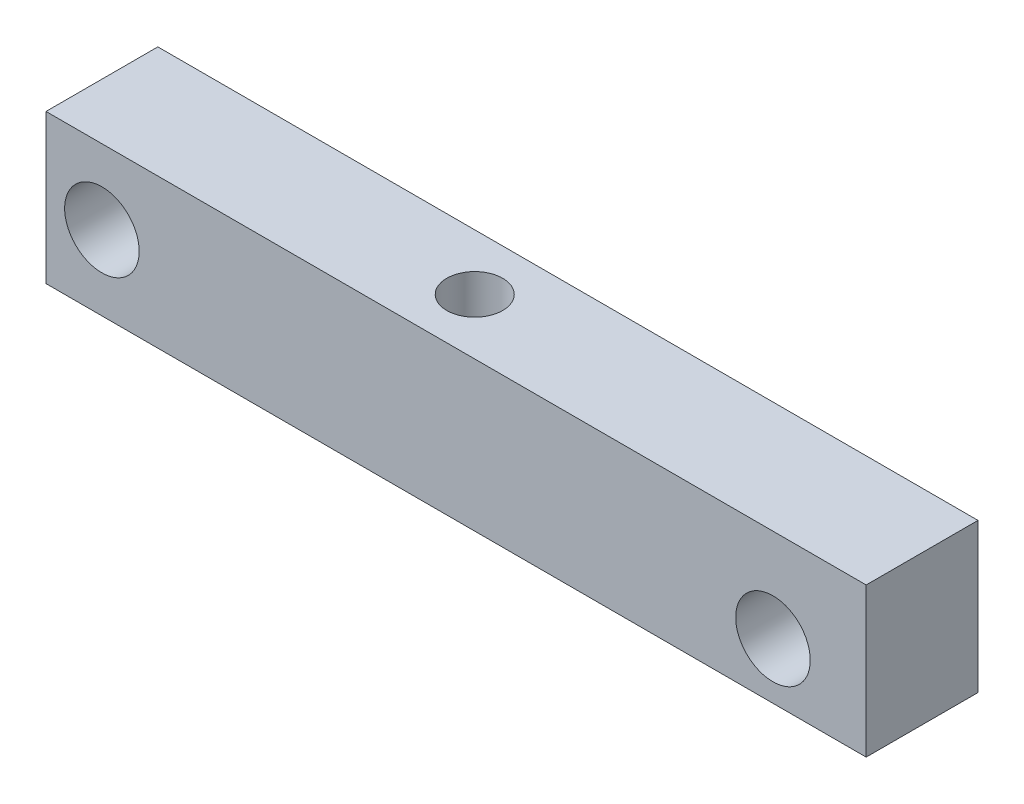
ISO-10303-21;
HEADER;
FILE_DESCRIPTION(('STEP AP214'),'2;1');
FILE_NAME('part.step','',(''),(''),'','','');
FILE_SCHEMA(('AUTOMOTIVE_DESIGN { 1 0 10303 214 1 1 1 1 }'));
ENDSEC;
DATA;
#1=APPLICATION_CONTEXT('core data for automotive mechanical design processes');
#2=APPLICATION_PROTOCOL_DEFINITION('international standard','automotive_design',2000,#1);
#3=PRODUCT_CONTEXT('',#1,'mechanical');
#4=PRODUCT('Part','Part','',(#3));
#5=PRODUCT_RELATED_PRODUCT_CATEGORY('part','',(#4));
#6=PRODUCT_DEFINITION_FORMATION('','',#4);
#7=PRODUCT_DEFINITION_CONTEXT('part definition',#1,'design');
#8=PRODUCT_DEFINITION('design','',#6,#7);
#9=PRODUCT_DEFINITION_SHAPE('','',#8);
#10=(LENGTH_UNIT() NAMED_UNIT(*) SI_UNIT(.MILLI.,.METRE.));
#11=(NAMED_UNIT(*) PLANE_ANGLE_UNIT() SI_UNIT($,.RADIAN.));
#12=(NAMED_UNIT(*) SI_UNIT($,.STERADIAN.) SOLID_ANGLE_UNIT());
#13=UNCERTAINTY_MEASURE_WITH_UNIT(LENGTH_MEASURE(1.E-05),#10,'distance_accuracy_value','');
#14=(GEOMETRIC_REPRESENTATION_CONTEXT(3) GLOBAL_UNCERTAINTY_ASSIGNED_CONTEXT((#13)) GLOBAL_UNIT_ASSIGNED_CONTEXT((#10,
#11,#12)) REPRESENTATION_CONTEXT('',''));
#15=CARTESIAN_POINT('',(0.,0.,0.));
#16=DIRECTION('',(0.,0.,1.));
#17=DIRECTION('',(1.,0.,0.));
#18=AXIS2_PLACEMENT_3D('',#15,#16,#17);
#19=CARTESIAN_POINT('',(11.,-2.,3.));
#20=DIRECTION('',(-1.,0.,0.));
#21=DIRECTION('',(0.,0.,1.));
#22=AXIS2_PLACEMENT_3D('',#19,#20,#21);
#23=PLANE('',#22);
#24=DIRECTION('',(0.,1.,0.));
#25=VECTOR('',#24,1.);
#26=CARTESIAN_POINT('',(11.,-2.,0.));
#27=LINE('',#26,#25);
#28=CARTESIAN_POINT('',(11.,-2.,0.));
#29=VERTEX_POINT('',#28);
#30=CARTESIAN_POINT('',(11.,2.,0.));
#31=VERTEX_POINT('',#30);
#32=EDGE_CURVE('E110',#29,#31,#27,.T.);
#33=ORIENTED_EDGE('',*,*,#32,.T.);
#34=DIRECTION('',(0.,0.,-1.));
#35=VECTOR('',#34,1.);
#36=CARTESIAN_POINT('',(11.,2.,3.));
#37=LINE('',#36,#35);
#38=CARTESIAN_POINT('',(11.,2.,3.));
#39=VERTEX_POINT('',#38);
#40=EDGE_CURVE('E11',#39,#31,#37,.T.);
#41=ORIENTED_EDGE('',*,*,#40,.F.);
#42=DIRECTION('',(0.,1.,0.));
#43=VECTOR('',#42,1.);
#44=CARTESIAN_POINT('',(11.,-2.,3.));
#45=LINE('',#44,#43);
#46=CARTESIAN_POINT('',(11.,-2.,3.));
#47=VERTEX_POINT('',#46);
#48=EDGE_CURVE('E94',#47,#39,#45,.T.);
#49=ORIENTED_EDGE('',*,*,#48,.F.);
#50=DIRECTION('',(0.,0.,-1.));
#51=VECTOR('',#50,1.);
#52=CARTESIAN_POINT('',(11.,-2.,3.));
#53=LINE('',#52,#51);
#54=EDGE_CURVE('E106',#47,#29,#53,.T.);
#55=ORIENTED_EDGE('',*,*,#54,.T.);
#56=EDGE_LOOP('',(#33,#41,#49,#55));
#57=FACE_BOUND('',#56,.T.);
#58=ADVANCED_FACE('F42',(#57),#23,.F.);
#59=CARTESIAN_POINT('',(-11.,2.,3.));
#60=DIRECTION('',(0.,-1.,0.));
#61=DIRECTION('',(0.,0.,-1.));
#62=AXIS2_PLACEMENT_3D('',#59,#60,#61);
#63=PLANE('',#62);
#64=CARTESIAN_POINT('',(-1.,2.,1.5));
#65=DIRECTION('',(0.,1.,0.));
#66=DIRECTION('',(0.,0.,1.));
#67=AXIS2_PLACEMENT_3D('',#64,#65,#66);
#68=CIRCLE('',#67,0.75);
#69=CARTESIAN_POINT('',(-1.,2.,2.25));
#70=VERTEX_POINT('',#69);
#71=EDGE_CURVE('E131',#70,#70,#68,.T.);
#72=ORIENTED_EDGE('',*,*,#71,.F.);
#73=EDGE_LOOP('',(#72));
#74=FACE_BOUND('',#73,.T.);
#75=DIRECTION('',(-1.,0.,0.));
#76=VECTOR('',#75,1.);
#77=CARTESIAN_POINT('',(-11.,2.,0.));
#78=LINE('',#77,#76);
#79=CARTESIAN_POINT('',(-11.,2.,0.));
#80=VERTEX_POINT('',#79);
#81=EDGE_CURVE('E99',#31,#80,#78,.T.);
#82=ORIENTED_EDGE('',*,*,#81,.T.);
#83=DIRECTION('',(0.,0.,-1.));
#84=VECTOR('',#83,1.);
#85=CARTESIAN_POINT('',(-11.,2.,3.));
#86=LINE('',#85,#84);
#87=CARTESIAN_POINT('',(-11.,2.,3.));
#88=VERTEX_POINT('',#87);
#89=EDGE_CURVE('E51',#88,#80,#86,.T.);
#90=ORIENTED_EDGE('',*,*,#89,.F.);
#91=DIRECTION('',(-1.,0.,0.));
#92=VECTOR('',#91,1.);
#93=CARTESIAN_POINT('',(-11.,2.,3.));
#94=LINE('',#93,#92);
#95=EDGE_CURVE('E89',#39,#88,#94,.T.);
#96=ORIENTED_EDGE('',*,*,#95,.F.);
#97=ORIENTED_EDGE('',*,*,#40,.T.);
#98=EDGE_LOOP('',(#82,#90,#96,#97));
#99=FACE_BOUND('',#98,.T.);
#100=ADVANCED_FACE('F98',(#74,#99),#63,.F.);
#101=CARTESIAN_POINT('',(-11.,-2.,3.));
#102=DIRECTION('',(1.,0.,0.));
#103=DIRECTION('',(0.,0.,-1.));
#104=AXIS2_PLACEMENT_3D('',#101,#102,#103);
#105=PLANE('',#104);
#106=DIRECTION('',(0.,-1.,0.));
#107=VECTOR('',#106,1.);
#108=CARTESIAN_POINT('',(-11.,-2.,0.));
#109=LINE('',#108,#107);
#110=CARTESIAN_POINT('',(-11.,-2.,0.));
#111=VERTEX_POINT('',#110);
#112=EDGE_CURVE('E76',#80,#111,#109,.T.);
#113=ORIENTED_EDGE('',*,*,#112,.T.);
#114=DIRECTION('',(0.,0.,-1.));
#115=VECTOR('',#114,1.);
#116=CARTESIAN_POINT('',(-11.,-2.,3.));
#117=LINE('',#116,#115);
#118=CARTESIAN_POINT('',(-11.,-2.,3.));
#119=VERTEX_POINT('',#118);
#120=EDGE_CURVE('E101',#119,#111,#117,.T.);
#121=ORIENTED_EDGE('',*,*,#120,.F.);
#122=DIRECTION('',(0.,-1.,0.));
#123=VECTOR('',#122,1.);
#124=CARTESIAN_POINT('',(-11.,-2.,3.));
#125=LINE('',#124,#123);
#126=EDGE_CURVE('E92',#88,#119,#125,.T.);
#127=ORIENTED_EDGE('',*,*,#126,.F.);
#128=ORIENTED_EDGE('',*,*,#89,.T.);
#129=EDGE_LOOP('',(#113,#121,#127,#128));
#130=FACE_BOUND('',#129,.T.);
#131=ADVANCED_FACE('F102',(#130),#105,.F.);
#132=CARTESIAN_POINT('',(-11.,-2.,3.));
#133=DIRECTION('',(0.,1.,0.));
#134=DIRECTION('',(0.,0.,1.));
#135=AXIS2_PLACEMENT_3D('',#132,#133,#134);
#136=PLANE('',#135);
#137=DIRECTION('',(1.,0.,0.));
#138=VECTOR('',#137,1.);
#139=CARTESIAN_POINT('',(-11.,-2.,0.));
#140=LINE('',#139,#138);
#141=EDGE_CURVE('E82',#111,#29,#140,.T.);
#142=ORIENTED_EDGE('',*,*,#141,.T.);
#143=ORIENTED_EDGE('',*,*,#54,.F.);
#144=DIRECTION('',(1.,0.,0.));
#145=VECTOR('',#144,1.);
#146=CARTESIAN_POINT('',(-11.,-2.,3.));
#147=LINE('',#146,#145);
#148=EDGE_CURVE('E59',#119,#47,#147,.T.);
#149=ORIENTED_EDGE('',*,*,#148,.F.);
#150=ORIENTED_EDGE('',*,*,#120,.T.);
#151=EDGE_LOOP('',(#142,#143,#149,#150));
#152=FACE_BOUND('',#151,.T.);
#153=ADVANCED_FACE('F124',(#152),#136,.F.);
#154=CARTESIAN_POINT('',(0.,0.,3.));
#155=DIRECTION('',(0.,0.,-1.));
#156=DIRECTION('',(-1.,0.,0.));
#157=AXIS2_PLACEMENT_3D('',#154,#155,#156);
#158=PLANE('',#157);
#159=CARTESIAN_POINT('',(8.5,-0.5,3.));
#160=DIRECTION('',(0.,0.,1.));
#161=DIRECTION('',(1.,0.,0.));
#162=AXIS2_PLACEMENT_3D('',#159,#160,#161);
#163=CIRCLE('',#162,1.);
#164=CARTESIAN_POINT('',(9.5,-0.5,3.));
#165=VERTEX_POINT('',#164);
#166=EDGE_CURVE('E135',#165,#165,#163,.T.);
#167=ORIENTED_EDGE('',*,*,#166,.F.);
#168=EDGE_LOOP('',(#167));
#169=FACE_BOUND('',#168,.T.);
#170=CARTESIAN_POINT('',(-9.5,0.,3.));
#171=DIRECTION('',(0.,0.,1.));
#172=DIRECTION('',(1.,0.,0.));
#173=AXIS2_PLACEMENT_3D('',#170,#171,#172);
#174=CIRCLE('',#173,1.);
#175=CARTESIAN_POINT('',(-8.5,0.,3.));
#176=VERTEX_POINT('',#175);
#177=EDGE_CURVE('E139',#176,#176,#174,.T.);
#178=ORIENTED_EDGE('',*,*,#177,.F.);
#179=EDGE_LOOP('',(#178));
#180=FACE_BOUND('',#179,.T.);
#181=ORIENTED_EDGE('',*,*,#48,.T.);
#182=ORIENTED_EDGE('',*,*,#95,.T.);
#183=ORIENTED_EDGE('',*,*,#126,.T.);
#184=ORIENTED_EDGE('',*,*,#148,.T.);
#185=EDGE_LOOP('',(#181,#182,#183,#184));
#186=FACE_BOUND('',#185,.T.);
#187=ADVANCED_FACE('F90',(#169,#180,#186),#158,.F.);
#188=CARTESIAN_POINT('',(0.,0.,0.));
#189=DIRECTION('',(0.,0.,-1.));
#190=DIRECTION('',(-1.,0.,0.));
#191=AXIS2_PLACEMENT_3D('',#188,#189,#190);
#192=PLANE('',#191);
#193=CARTESIAN_POINT('',(8.5,-0.5,0.));
#194=DIRECTION('',(0.,0.,-1.));
#195=DIRECTION('',(-1.,0.,0.));
#196=AXIS2_PLACEMENT_3D('',#193,#194,#195);
#197=CIRCLE('',#196,1.);
#198=CARTESIAN_POINT('',(9.5,-0.5,0.));
#199=VERTEX_POINT('',#198);
#200=EDGE_CURVE('E147',#199,#199,#197,.F.);
#201=ORIENTED_EDGE('',*,*,#200,.T.);
#202=EDGE_LOOP('',(#201));
#203=FACE_BOUND('',#202,.T.);
#204=CARTESIAN_POINT('',(-9.5,0.,0.));
#205=DIRECTION('',(0.,0.,-1.));
#206=DIRECTION('',(-1.,0.,0.));
#207=AXIS2_PLACEMENT_3D('',#204,#205,#206);
#208=CIRCLE('',#207,1.);
#209=CARTESIAN_POINT('',(-8.5,0.,0.));
#210=VERTEX_POINT('',#209);
#211=EDGE_CURVE('E143',#210,#210,#208,.F.);
#212=ORIENTED_EDGE('',*,*,#211,.T.);
#213=EDGE_LOOP('',(#212));
#214=FACE_BOUND('',#213,.T.);
#215=ORIENTED_EDGE('',*,*,#32,.F.);
#216=ORIENTED_EDGE('',*,*,#141,.F.);
#217=ORIENTED_EDGE('',*,*,#112,.F.);
#218=ORIENTED_EDGE('',*,*,#81,.F.);
#219=EDGE_LOOP('',(#215,#216,#217,#218));
#220=FACE_BOUND('',#219,.T.);
#221=ADVANCED_FACE('F127',(#203,#214,#220),#192,.T.);
#222=CARTESIAN_POINT('',(-1.,-1.,1.5));
#223=DIRECTION('',(0.,1.,0.));
#224=DIRECTION('',(0.,0.,1.));
#225=AXIS2_PLACEMENT_3D('',#222,#223,#224);
#226=CYLINDRICAL_SURFACE('',#225,0.75);
#227=CARTESIAN_POINT('',(-1.,-1.,1.5));
#228=DIRECTION('',(0.,1.,0.));
#229=DIRECTION('',(0.,0.,1.));
#230=AXIS2_PLACEMENT_3D('',#227,#228,#229);
#231=CIRCLE('',#230,0.75);
#232=CARTESIAN_POINT('',(-1.,-1.,2.25));
#233=VERTEX_POINT('',#232);
#234=EDGE_CURVE('E114',#233,#233,#231,.T.);
#235=ORIENTED_EDGE('',*,*,#234,.F.);
#236=EDGE_LOOP('',(#235));
#237=FACE_BOUND('',#236,.T.);
#238=ORIENTED_EDGE('',*,*,#71,.T.);
#239=EDGE_LOOP('',(#238));
#240=FACE_BOUND('',#239,.T.);
#241=ADVANCED_FACE('F173',(#237,#240),#226,.F.);
#242=CARTESIAN_POINT('',(-1.,-1.,1.5));
#243=DIRECTION('',(0.,1.,0.));
#244=DIRECTION('',(0.,0.,1.));
#245=AXIS2_PLACEMENT_3D('',#242,#243,#244);
#246=PLANE('',#245);
#247=ORIENTED_EDGE('',*,*,#234,.T.);
#248=EDGE_LOOP('',(#247));
#249=FACE_BOUND('',#248,.T.);
#250=ADVANCED_FACE('F164',(#249),#246,.T.);
#251=CARTESIAN_POINT('',(-9.5,0.,-0.00100000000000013));
#252=DIRECTION('',(0.,0.,1.));
#253=DIRECTION('',(1.,0.,0.));
#254=AXIS2_PLACEMENT_3D('',#251,#252,#253);
#255=CYLINDRICAL_SURFACE('',#254,1.);
#256=CARTESIAN_POINT('',(-8.5,0.,0.));
#257=CARTESIAN_POINT('',(-8.5,0.,0.03125));
#258=CARTESIAN_POINT('',(-8.5,0.,0.0625));
#259=CARTESIAN_POINT('',(-8.5,0.,0.125));
#260=CARTESIAN_POINT('',(-8.5,0.,0.15625));
#261=CARTESIAN_POINT('',(-8.5,0.,0.21875));
#262=CARTESIAN_POINT('',(-8.5,0.,0.25));
#263=CARTESIAN_POINT('',(-8.5,0.,0.3125));
#264=CARTESIAN_POINT('',(-8.5,0.,0.34375));
#265=CARTESIAN_POINT('',(-8.5,0.,0.40625));
#266=CARTESIAN_POINT('',(-8.5,0.,0.4375));
#267=CARTESIAN_POINT('',(-8.5,0.,0.5));
#268=CARTESIAN_POINT('',(-8.5,0.,0.53125));
#269=CARTESIAN_POINT('',(-8.5,0.,0.59375));
#270=CARTESIAN_POINT('',(-8.5,0.,0.625));
#271=CARTESIAN_POINT('',(-8.5,0.,0.6875));
#272=CARTESIAN_POINT('',(-8.5,0.,0.71875));
#273=CARTESIAN_POINT('',(-8.5,0.,0.78125));
#274=CARTESIAN_POINT('',(-8.5,0.,0.8125));
#275=CARTESIAN_POINT('',(-8.5,0.,0.875));
#276=CARTESIAN_POINT('',(-8.5,0.,0.90625));
#277=CARTESIAN_POINT('',(-8.5,0.,0.96875));
#278=CARTESIAN_POINT('',(-8.5,0.,1.));
#279=CARTESIAN_POINT('',(-8.5,0.,1.0625));
#280=CARTESIAN_POINT('',(-8.5,0.,1.09375));
#281=CARTESIAN_POINT('',(-8.5,0.,1.15625));
#282=CARTESIAN_POINT('',(-8.5,0.,1.1875));
#283=CARTESIAN_POINT('',(-8.5,0.,1.25));
#284=CARTESIAN_POINT('',(-8.5,0.,1.28125));
#285=CARTESIAN_POINT('',(-8.5,0.,1.34375));
#286=CARTESIAN_POINT('',(-8.5,0.,1.375));
#287=CARTESIAN_POINT('',(-8.5,0.,1.4375));
#288=CARTESIAN_POINT('',(-8.5,0.,1.46875));
#289=CARTESIAN_POINT('',(-8.5,0.,1.53125));
#290=CARTESIAN_POINT('',(-8.5,0.,1.5625));
#291=CARTESIAN_POINT('',(-8.5,0.,1.625));
#292=CARTESIAN_POINT('',(-8.5,0.,1.65625));
#293=CARTESIAN_POINT('',(-8.5,0.,1.71875));
#294=CARTESIAN_POINT('',(-8.5,0.,1.75));
#295=CARTESIAN_POINT('',(-8.5,0.,1.8125));
#296=CARTESIAN_POINT('',(-8.5,0.,1.84375));
#297=CARTESIAN_POINT('',(-8.5,0.,1.90625));
#298=CARTESIAN_POINT('',(-8.5,0.,1.9375));
#299=CARTESIAN_POINT('',(-8.5,0.,2.));
#300=CARTESIAN_POINT('',(-8.5,0.,2.03125));
#301=CARTESIAN_POINT('',(-8.5,0.,2.09375));
#302=CARTESIAN_POINT('',(-8.5,0.,2.125));
#303=CARTESIAN_POINT('',(-8.5,0.,2.1875));
#304=CARTESIAN_POINT('',(-8.5,0.,2.21875));
#305=CARTESIAN_POINT('',(-8.5,0.,2.28125));
#306=CARTESIAN_POINT('',(-8.5,0.,2.3125));
#307=CARTESIAN_POINT('',(-8.5,0.,2.375));
#308=CARTESIAN_POINT('',(-8.5,0.,2.40625));
#309=CARTESIAN_POINT('',(-8.5,0.,2.46875));
#310=CARTESIAN_POINT('',(-8.5,0.,2.5));
#311=CARTESIAN_POINT('',(-8.5,0.,2.5625));
#312=CARTESIAN_POINT('',(-8.5,0.,2.59375));
#313=CARTESIAN_POINT('',(-8.5,0.,2.65625));
#314=CARTESIAN_POINT('',(-8.5,0.,2.6875));
#315=CARTESIAN_POINT('',(-8.5,0.,2.75));
#316=CARTESIAN_POINT('',(-8.5,0.,2.78125));
#317=CARTESIAN_POINT('',(-8.5,0.,2.84375));
#318=CARTESIAN_POINT('',(-8.5,0.,2.875));
#319=CARTESIAN_POINT('',(-8.5,0.,2.9375));
#320=CARTESIAN_POINT('',(-8.5,0.,2.96875));
#321=CARTESIAN_POINT('',(-8.5,0.,3.));
#322=B_SPLINE_CURVE_WITH_KNOTS('',3,(#256,#257,#258,#259,#260,#261,#262,#263,#264,#265,#266,
#267,#268,#269,#270,#271,#272,#273,#274,#275,#276,#277,#278,#279,#280,#281,#282,#283,#284,#285,
#286,#287,#288,#289,#290,#291,#292,#293,#294,#295,#296,#297,#298,#299,#300,#301,#302,#303,#304,
#305,#306,#307,#308,#309,#310,#311,#312,#313,#314,#315,#316,#317,#318,#319,#320,#321),
.UNSPECIFIED.,.F.,.F.,(4,2,2,2,2,2,2,2,2,2,2,2,2,2,2,2,2,2,2,2,2,2,2,2,2,2,2,2,2,2,2,2,4),(0.,
0.09375,0.1875,0.28125,0.375,0.46875,0.5625,0.65625,0.75,0.84375,0.9375,1.03125,1.125,1.21875,
1.3125,1.40625,1.5,1.59375,1.6875,1.78125,1.875,1.96875,2.0625,2.15625,2.25,2.34375,2.4375,
2.53125,2.625,2.71875,2.8125,2.90625,3.),.UNSPECIFIED.);
#323=EDGE_CURVE('BSEAM162',#210,#176,#322,.T.);
#324=ORIENTED_EDGE('',*,*,#211,.F.);
#325=ORIENTED_EDGE('',*,*,#177,.T.);
#326=ORIENTED_EDGE('',*,*,#323,.T.);
#327=ORIENTED_EDGE('',*,*,#323,.F.);
#328=EDGE_LOOP('',(#324,#326,#325,#327));
#329=FACE_BOUND('',#328,.T.);
#330=ADVANCED_FACE('F162',(#329),#255,.F.);
#331=CARTESIAN_POINT('',(8.5,-0.5,-0.00100000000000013));
#332=DIRECTION('',(0.,0.,1.));
#333=DIRECTION('',(1.,0.,0.));
#334=AXIS2_PLACEMENT_3D('',#331,#332,#333);
#335=CYLINDRICAL_SURFACE('',#334,1.);
#336=CARTESIAN_POINT('',(9.5,-0.5,0.));
#337=CARTESIAN_POINT('',(9.5,-0.5,0.03125));
#338=CARTESIAN_POINT('',(9.5,-0.5,0.0625));
#339=CARTESIAN_POINT('',(9.5,-0.5,0.125));
#340=CARTESIAN_POINT('',(9.5,-0.5,0.15625));
#341=CARTESIAN_POINT('',(9.5,-0.5,0.21875));
#342=CARTESIAN_POINT('',(9.5,-0.5,0.25));
#343=CARTESIAN_POINT('',(9.5,-0.5,0.3125));
#344=CARTESIAN_POINT('',(9.5,-0.5,0.34375));
#345=CARTESIAN_POINT('',(9.5,-0.5,0.40625));
#346=CARTESIAN_POINT('',(9.5,-0.5,0.4375));
#347=CARTESIAN_POINT('',(9.5,-0.5,0.5));
#348=CARTESIAN_POINT('',(9.5,-0.5,0.53125));
#349=CARTESIAN_POINT('',(9.5,-0.5,0.59375));
#350=CARTESIAN_POINT('',(9.5,-0.5,0.625));
#351=CARTESIAN_POINT('',(9.5,-0.5,0.6875));
#352=CARTESIAN_POINT('',(9.5,-0.5,0.71875));
#353=CARTESIAN_POINT('',(9.5,-0.5,0.78125));
#354=CARTESIAN_POINT('',(9.5,-0.5,0.8125));
#355=CARTESIAN_POINT('',(9.5,-0.5,0.875));
#356=CARTESIAN_POINT('',(9.5,-0.5,0.90625));
#357=CARTESIAN_POINT('',(9.5,-0.5,0.96875));
#358=CARTESIAN_POINT('',(9.5,-0.5,1.));
#359=CARTESIAN_POINT('',(9.5,-0.5,1.0625));
#360=CARTESIAN_POINT('',(9.5,-0.5,1.09375));
#361=CARTESIAN_POINT('',(9.5,-0.5,1.15625));
#362=CARTESIAN_POINT('',(9.5,-0.5,1.1875));
#363=CARTESIAN_POINT('',(9.5,-0.5,1.25));
#364=CARTESIAN_POINT('',(9.5,-0.5,1.28125));
#365=CARTESIAN_POINT('',(9.5,-0.5,1.34375));
#366=CARTESIAN_POINT('',(9.5,-0.5,1.375));
#367=CARTESIAN_POINT('',(9.5,-0.5,1.4375));
#368=CARTESIAN_POINT('',(9.5,-0.5,1.46875));
#369=CARTESIAN_POINT('',(9.5,-0.5,1.53125));
#370=CARTESIAN_POINT('',(9.5,-0.5,1.5625));
#371=CARTESIAN_POINT('',(9.5,-0.5,1.625));
#372=CARTESIAN_POINT('',(9.5,-0.5,1.65625));
#373=CARTESIAN_POINT('',(9.5,-0.5,1.71875));
#374=CARTESIAN_POINT('',(9.5,-0.5,1.75));
#375=CARTESIAN_POINT('',(9.5,-0.5,1.8125));
#376=CARTESIAN_POINT('',(9.5,-0.5,1.84375));
#377=CARTESIAN_POINT('',(9.5,-0.5,1.90625));
#378=CARTESIAN_POINT('',(9.5,-0.5,1.9375));
#379=CARTESIAN_POINT('',(9.5,-0.5,2.));
#380=CARTESIAN_POINT('',(9.5,-0.5,2.03125));
#381=CARTESIAN_POINT('',(9.5,-0.5,2.09375));
#382=CARTESIAN_POINT('',(9.5,-0.5,2.125));
#383=CARTESIAN_POINT('',(9.5,-0.5,2.1875));
#384=CARTESIAN_POINT('',(9.5,-0.5,2.21875));
#385=CARTESIAN_POINT('',(9.5,-0.5,2.28125));
#386=CARTESIAN_POINT('',(9.5,-0.5,2.3125));
#387=CARTESIAN_POINT('',(9.5,-0.5,2.375));
#388=CARTESIAN_POINT('',(9.5,-0.5,2.40625));
#389=CARTESIAN_POINT('',(9.5,-0.5,2.46875));
#390=CARTESIAN_POINT('',(9.5,-0.5,2.5));
#391=CARTESIAN_POINT('',(9.5,-0.5,2.5625));
#392=CARTESIAN_POINT('',(9.5,-0.5,2.59375));
#393=CARTESIAN_POINT('',(9.5,-0.5,2.65625));
#394=CARTESIAN_POINT('',(9.5,-0.5,2.6875));
#395=CARTESIAN_POINT('',(9.5,-0.5,2.75));
#396=CARTESIAN_POINT('',(9.5,-0.5,2.78125));
#397=CARTESIAN_POINT('',(9.5,-0.5,2.84375));
#398=CARTESIAN_POINT('',(9.5,-0.5,2.875));
#399=CARTESIAN_POINT('',(9.5,-0.5,2.9375));
#400=CARTESIAN_POINT('',(9.5,-0.5,2.96875));
#401=CARTESIAN_POINT('',(9.5,-0.5,3.));
#402=B_SPLINE_CURVE_WITH_KNOTS('',3,(#336,#337,#338,#339,#340,#341,#342,#343,#344,#345,#346,
#347,#348,#349,#350,#351,#352,#353,#354,#355,#356,#357,#358,#359,#360,#361,#362,#363,#364,#365,
#366,#367,#368,#369,#370,#371,#372,#373,#374,#375,#376,#377,#378,#379,#380,#381,#382,#383,#384,
#385,#386,#387,#388,#389,#390,#391,#392,#393,#394,#395,#396,#397,#398,#399,#400,#401),
.UNSPECIFIED.,.F.,.F.,(4,2,2,2,2,2,2,2,2,2,2,2,2,2,2,2,2,2,2,2,2,2,2,2,2,2,2,2,2,2,2,2,4),(0.,
0.09375,0.1875,0.28125,0.375,0.46875,0.5625,0.65625,0.75,0.84375,0.9375,1.03125,1.125,1.21875,
1.3125,1.40625,1.5,1.59375,1.6875,1.78125,1.875,1.96875,2.0625,2.15625,2.25,2.34375,2.4375,
2.53125,2.625,2.71875,2.8125,2.90625,3.),.UNSPECIFIED.);
#403=EDGE_CURVE('BSEAM155',#199,#165,#402,.T.);
#404=ORIENTED_EDGE('',*,*,#200,.F.);
#405=ORIENTED_EDGE('',*,*,#166,.T.);
#406=ORIENTED_EDGE('',*,*,#403,.T.);
#407=ORIENTED_EDGE('',*,*,#403,.F.);
#408=EDGE_LOOP('',(#404,#406,#405,#407));
#409=FACE_BOUND('',#408,.T.);
#410=ADVANCED_FACE('F155',(#409),#335,.F.);
#411=CLOSED_SHELL('',(#58,#100,#131,#153,#187,#221,#241,#250,#330,#410));
#412=MANIFOLD_SOLID_BREP('B2',#411);
#413=ADVANCED_BREP_SHAPE_REPRESENTATION('',(#18,#412),#14);
#414=SHAPE_DEFINITION_REPRESENTATION(#9,#413);
ENDSEC;
END-ISO-10303-21;
